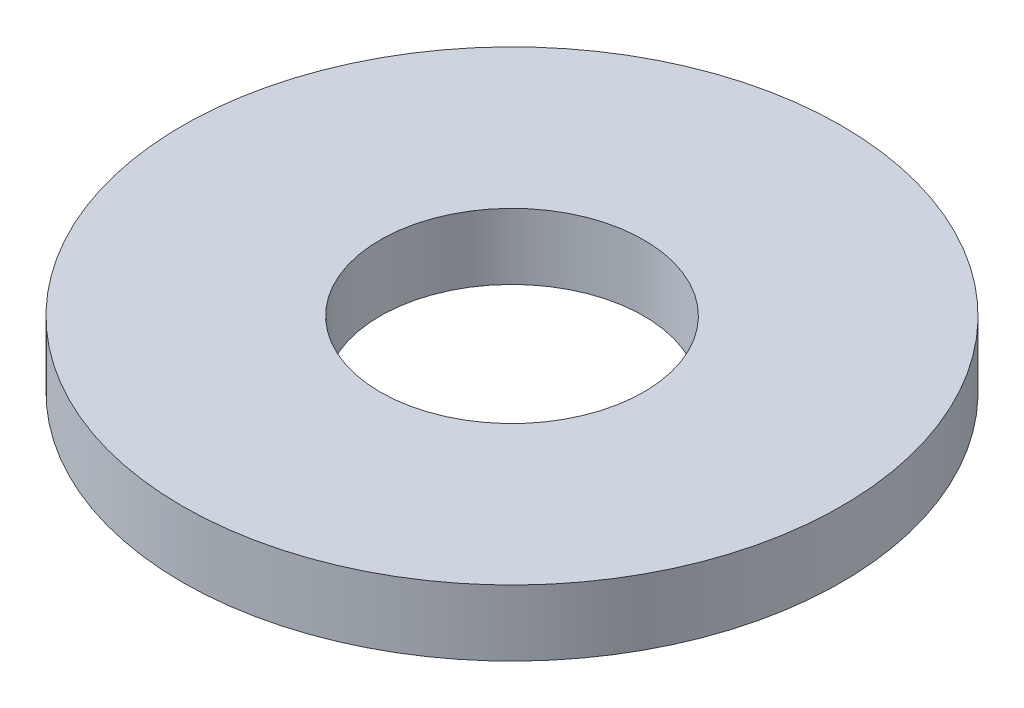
ISO-10303-21;
HEADER;
FILE_DESCRIPTION(('STEP AP214'),'2;1');
FILE_NAME('part.step','',(''),(''),'','','');
FILE_SCHEMA(('AUTOMOTIVE_DESIGN { 1 0 10303 214 1 1 1 1 }'));
ENDSEC;
DATA;
#1=APPLICATION_CONTEXT('core data for automotive mechanical design processes');
#2=APPLICATION_PROTOCOL_DEFINITION('international standard','automotive_design',2000,#1);
#3=PRODUCT_CONTEXT('',#1,'mechanical');
#4=PRODUCT('Part','Part','',(#3));
#5=PRODUCT_RELATED_PRODUCT_CATEGORY('part','',(#4));
#6=PRODUCT_DEFINITION_FORMATION('','',#4);
#7=PRODUCT_DEFINITION_CONTEXT('part definition',#1,'design');
#8=PRODUCT_DEFINITION('design','',#6,#7);
#9=PRODUCT_DEFINITION_SHAPE('','',#8);
#10=(LENGTH_UNIT() NAMED_UNIT(*) SI_UNIT(.MILLI.,.METRE.));
#11=(NAMED_UNIT(*) PLANE_ANGLE_UNIT() SI_UNIT($,.RADIAN.));
#12=(NAMED_UNIT(*) SI_UNIT($,.STERADIAN.) SOLID_ANGLE_UNIT());
#13=UNCERTAINTY_MEASURE_WITH_UNIT(LENGTH_MEASURE(1.E-05),#10,'distance_accuracy_value','');
#14=(GEOMETRIC_REPRESENTATION_CONTEXT(3) GLOBAL_UNCERTAINTY_ASSIGNED_CONTEXT((#13)) GLOBAL_UNIT_ASSIGNED_CONTEXT((#10,
#11,#12)) REPRESENTATION_CONTEXT('',''));
#15=CARTESIAN_POINT('',(0.,0.,0.));
#16=DIRECTION('',(0.,0.,1.));
#17=DIRECTION('',(1.,0.,0.));
#18=AXIS2_PLACEMENT_3D('',#15,#16,#17);
#19=CARTESIAN_POINT('',(0.,1.5875,0.));
#20=DIRECTION('',(0.,1.,0.));
#21=DIRECTION('',(0.,0.,1.));
#22=AXIS2_PLACEMENT_3D('',#19,#20,#21);
#23=PLANE('',#22);
#24=CARTESIAN_POINT('',(0.,1.5875,0.));
#25=DIRECTION('',(0.,1.,0.));
#26=DIRECTION('',(0.,0.,1.));
#27=AXIS2_PLACEMENT_3D('',#24,#25,#26);
#28=CIRCLE('',#27,7.9375);
#29=CARTESIAN_POINT('',(0.,1.5875,7.9375));
#30=VERTEX_POINT('',#29);
#31=EDGE_CURVE('E10',#30,#30,#28,.T.);
#32=ORIENTED_EDGE('',*,*,#31,.T.);
#33=EDGE_LOOP('',(#32));
#34=FACE_BOUND('',#33,.T.);
#35=CARTESIAN_POINT('',(0.,1.5875,0.));
#36=DIRECTION('',(0.,1.,0.));
#37=DIRECTION('',(0.,0.,1.));
#38=AXIS2_PLACEMENT_3D('',#35,#36,#37);
#39=CIRCLE('',#38,3.175);
#40=CARTESIAN_POINT('',(0.,1.5875,3.175));
#41=VERTEX_POINT('',#40);
#42=EDGE_CURVE('E46',#41,#41,#39,.T.);
#43=ORIENTED_EDGE('',*,*,#42,.F.);
#44=EDGE_LOOP('',(#43));
#45=FACE_BOUND('',#44,.T.);
#46=ADVANCED_FACE('F35',(#34,#45),#23,.T.);
#47=CARTESIAN_POINT('',(0.,0.,0.));
#48=DIRECTION('',(0.,1.,0.));
#49=DIRECTION('',(0.,0.,1.));
#50=AXIS2_PLACEMENT_3D('',#47,#48,#49);
#51=PLANE('',#50);
#52=CARTESIAN_POINT('',(0.,0.,0.));
#53=DIRECTION('',(0.,1.,0.));
#54=DIRECTION('',(0.,0.,1.));
#55=AXIS2_PLACEMENT_3D('',#52,#53,#54);
#56=CIRCLE('',#55,7.9375);
#57=CARTESIAN_POINT('',(0.,0.,7.9375));
#58=VERTEX_POINT('',#57);
#59=EDGE_CURVE('E39',#58,#58,#56,.T.);
#60=ORIENTED_EDGE('',*,*,#59,.F.);
#61=EDGE_LOOP('',(#60));
#62=FACE_BOUND('',#61,.T.);
#63=CARTESIAN_POINT('',(0.,0.,0.));
#64=DIRECTION('',(0.,1.,0.));
#65=DIRECTION('',(0.,0.,1.));
#66=AXIS2_PLACEMENT_3D('',#63,#64,#65);
#67=CIRCLE('',#66,3.175);
#68=CARTESIAN_POINT('',(0.,0.,3.175));
#69=VERTEX_POINT('',#68);
#70=EDGE_CURVE('E48',#69,#69,#67,.T.);
#71=ORIENTED_EDGE('',*,*,#70,.T.);
#72=EDGE_LOOP('',(#71));
#73=FACE_BOUND('',#72,.T.);
#74=ADVANCED_FACE('F58',(#62,#73),#51,.F.);
#75=CARTESIAN_POINT('',(0.,1.5875,0.));
#76=DIRECTION('',(0.,-1.,0.));
#77=DIRECTION('',(0.,0.,-1.));
#78=AXIS2_PLACEMENT_3D('',#75,#76,#77);
#79=CYLINDRICAL_SURFACE('',#78,7.9375);
#80=ORIENTED_EDGE('',*,*,#31,.F.);
#81=EDGE_LOOP('',(#80));
#82=FACE_BOUND('',#81,.T.);
#83=ORIENTED_EDGE('',*,*,#59,.T.);
#84=EDGE_LOOP('',(#83));
#85=FACE_BOUND('',#84,.T.);
#86=ADVANCED_FACE('F37',(#82,#85),#79,.T.);
#87=CARTESIAN_POINT('',(0.,1.5875,0.));
#88=DIRECTION('',(0.,-1.,0.));
#89=DIRECTION('',(0.,0.,-1.));
#90=AXIS2_PLACEMENT_3D('',#87,#88,#89);
#91=CYLINDRICAL_SURFACE('',#90,3.175);
#92=ORIENTED_EDGE('',*,*,#42,.T.);
#93=EDGE_LOOP('',(#92));
#94=FACE_BOUND('',#93,.T.);
#95=ORIENTED_EDGE('',*,*,#70,.F.);
#96=EDGE_LOOP('',(#95));
#97=FACE_BOUND('',#96,.T.);
#98=ADVANCED_FACE('F54',(#94,#97),#91,.F.);
#99=CLOSED_SHELL('',(#46,#74,#86,#98));
#100=MANIFOLD_SOLID_BREP('B2',#99);
#101=ADVANCED_BREP_SHAPE_REPRESENTATION('',(#18,#100),#14);
#102=SHAPE_DEFINITION_REPRESENTATION(#9,#101);
ENDSEC;
END-ISO-10303-21;
